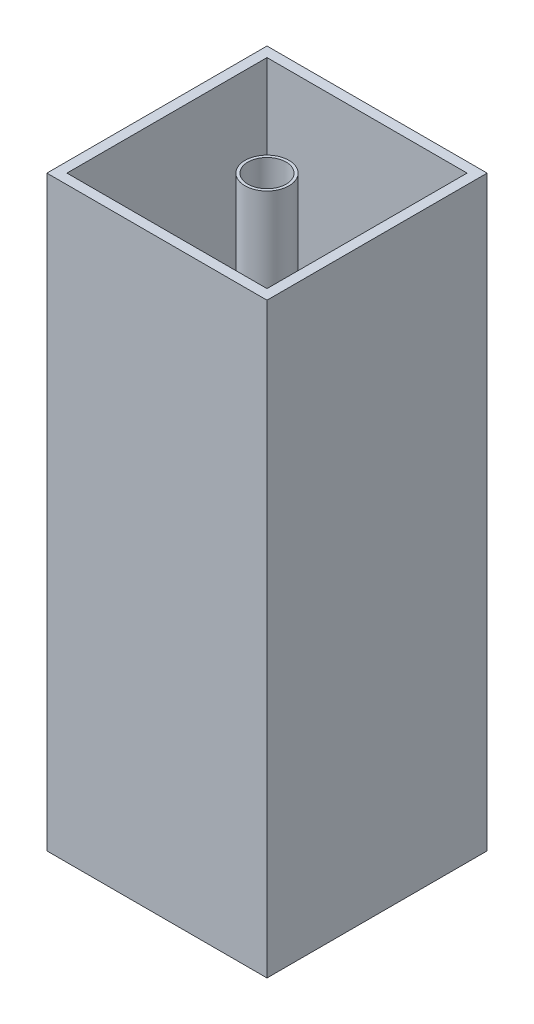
ISO-10303-21;
HEADER;
FILE_DESCRIPTION(('STEP AP214'),'2;1');
FILE_NAME('part.step','',(''),(''),'','','');
FILE_SCHEMA(('AUTOMOTIVE_DESIGN { 1 0 10303 214 1 1 1 1 }'));
ENDSEC;
DATA;
#1=APPLICATION_CONTEXT('core data for automotive mechanical design processes');
#2=APPLICATION_PROTOCOL_DEFINITION('international standard','automotive_design',2000,#1);
#3=PRODUCT_CONTEXT('',#1,'mechanical');
#4=PRODUCT('Part','Part','',(#3));
#5=PRODUCT_RELATED_PRODUCT_CATEGORY('part','',(#4));
#6=PRODUCT_DEFINITION_FORMATION('','',#4);
#7=PRODUCT_DEFINITION_CONTEXT('part definition',#1,'design');
#8=PRODUCT_DEFINITION('design','',#6,#7);
#9=PRODUCT_DEFINITION_SHAPE('','',#8);
#10=(LENGTH_UNIT() NAMED_UNIT(*) SI_UNIT(.MILLI.,.METRE.));
#11=(NAMED_UNIT(*) PLANE_ANGLE_UNIT() SI_UNIT($,.RADIAN.));
#12=(NAMED_UNIT(*) SI_UNIT($,.STERADIAN.) SOLID_ANGLE_UNIT());
#13=UNCERTAINTY_MEASURE_WITH_UNIT(LENGTH_MEASURE(1.E-05),#10,'distance_accuracy_value','');
#14=(GEOMETRIC_REPRESENTATION_CONTEXT(3) GLOBAL_UNCERTAINTY_ASSIGNED_CONTEXT((#13)) GLOBAL_UNIT_ASSIGNED_CONTEXT((#10,
#11,#12)) REPRESENTATION_CONTEXT('',''));
#15=CARTESIAN_POINT('',(0.,0.,0.));
#16=DIRECTION('',(0.,0.,1.));
#17=DIRECTION('',(1.,0.,0.));
#18=AXIS2_PLACEMENT_3D('',#15,#16,#17);
#19=CARTESIAN_POINT('',(0.,9.9999999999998,0.));
#20=DIRECTION('',(0.,1.,0.));
#21=DIRECTION('',(0.,0.,1.));
#22=AXIS2_PLACEMENT_3D('',#19,#20,#21);
#23=PLANE('',#22);
#24=CARTESIAN_POINT('',(0.,9.99999999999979,0.));
#25=DIRECTION('',(0.,1.,0.));
#26=DIRECTION('',(0.,0.,1.));
#27=AXIS2_PLACEMENT_3D('',#24,#25,#26);
#28=CIRCLE('',#27,15.);
#29=CARTESIAN_POINT('',(0.,9.99999999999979,15.));
#30=VERTEX_POINT('',#29);
#31=EDGE_CURVE('E177',#30,#30,#28,.T.);
#32=ORIENTED_EDGE('',*,*,#31,.F.);
#33=EDGE_LOOP('',(#32));
#34=FACE_BOUND('',#33,.T.);
#35=DIRECTION('',(1.,0.,0.));
#36=VECTOR('',#35,1.);
#37=CARTESIAN_POINT('',(0.,9.9999999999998,68.1708922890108));
#38=LINE('',#37,#36);
#39=CARTESIAN_POINT('',(-68.1708922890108,9.9999999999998,68.1708922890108));
#40=VERTEX_POINT('',#39);
#41=CARTESIAN_POINT('',(68.1708922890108,9.9999999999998,68.1708922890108));
#42=VERTEX_POINT('',#41);
#43=EDGE_CURVE('E148',#40,#42,#38,.T.);
#44=ORIENTED_EDGE('',*,*,#43,.T.);
#45=DIRECTION('',(0.,0.,-1.));
#46=VECTOR('',#45,1.);
#47=CARTESIAN_POINT('',(68.1708922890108,9.9999999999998,0.));
#48=LINE('',#47,#46);
#49=CARTESIAN_POINT('',(68.1708922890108,9.9999999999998,-68.1708922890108));
#50=VERTEX_POINT('',#49);
#51=EDGE_CURVE('E114',#42,#50,#48,.T.);
#52=ORIENTED_EDGE('',*,*,#51,.T.);
#53=DIRECTION('',(1.,0.,0.));
#54=VECTOR('',#53,1.);
#55=CARTESIAN_POINT('',(0.,9.9999999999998,-68.1708922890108));
#56=LINE('',#55,#54);
#57=CARTESIAN_POINT('',(-68.1708922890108,9.9999999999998,-68.1708922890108));
#58=VERTEX_POINT('',#57);
#59=EDGE_CURVE('E155',#58,#50,#56,.T.);
#60=ORIENTED_EDGE('',*,*,#59,.F.);
#61=DIRECTION('',(0.,0.,-1.));
#62=VECTOR('',#61,1.);
#63=CARTESIAN_POINT('',(-68.1708922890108,9.9999999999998,0.));
#64=LINE('',#63,#62);
#65=EDGE_CURVE('E153',#40,#58,#64,.T.);
#66=ORIENTED_EDGE('',*,*,#65,.F.);
#67=EDGE_LOOP('',(#44,#52,#60,#66));
#68=FACE_BOUND('',#67,.T.);
#69=ADVANCED_FACE('F42',(#34,#68),#23,.T.);
#70=CARTESIAN_POINT('',(0.,400.,0.));
#71=DIRECTION('',(0.,-1.,0.));
#72=DIRECTION('',(0.,0.,-1.));
#73=AXIS2_PLACEMENT_3D('',#70,#71,#72);
#74=CYLINDRICAL_SURFACE('',#73,15.);
#75=ORIENTED_EDGE('',*,*,#31,.T.);
#76=EDGE_LOOP('',(#75));
#77=FACE_BOUND('',#76,.T.);
#78=CARTESIAN_POINT('',(0.,400.,0.));
#79=DIRECTION('',(0.,1.,0.));
#80=DIRECTION('',(0.,0.,1.));
#81=AXIS2_PLACEMENT_3D('',#78,#79,#80);
#82=CIRCLE('',#81,15.);
#83=CARTESIAN_POINT('',(0.,400.,15.));
#84=VERTEX_POINT('',#83);
#85=EDGE_CURVE('E11',#84,#84,#82,.T.);
#86=ORIENTED_EDGE('',*,*,#85,.F.);
#87=EDGE_LOOP('',(#86));
#88=FACE_BOUND('',#87,.T.);
#89=ADVANCED_FACE('F44',(#77,#88),#74,.T.);
#90=CARTESIAN_POINT('',(0.,400.,0.));
#91=DIRECTION('',(0.,1.,0.));
#92=DIRECTION('',(0.,0.,1.));
#93=AXIS2_PLACEMENT_3D('',#90,#91,#92);
#94=PLANE('',#93);
#95=CARTESIAN_POINT('',(0.,400.,0.));
#96=DIRECTION('',(0.,1.,0.));
#97=DIRECTION('',(0.,0.,1.));
#98=AXIS2_PLACEMENT_3D('',#95,#96,#97);
#99=CIRCLE('',#98,13.0542104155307);
#100=CARTESIAN_POINT('',(0.,400.,13.0542104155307));
#101=VERTEX_POINT('',#100);
#102=EDGE_CURVE('E51',#101,#101,#99,.T.);
#103=ORIENTED_EDGE('',*,*,#102,.F.);
#104=EDGE_LOOP('',(#103));
#105=FACE_BOUND('',#104,.T.);
#106=ORIENTED_EDGE('',*,*,#85,.T.);
#107=EDGE_LOOP('',(#106));
#108=FACE_BOUND('',#107,.T.);
#109=ADVANCED_FACE('F185',(#105,#108),#94,.T.);
#110=CARTESIAN_POINT('',(0.,0.,0.));
#111=DIRECTION('',(0.,1.,0.));
#112=DIRECTION('',(0.,0.,1.));
#113=AXIS2_PLACEMENT_3D('',#110,#111,#112);
#114=CYLINDRICAL_SURFACE('',#113,13.0542104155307);
#115=CARTESIAN_POINT('',(0.,9.9999999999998,0.));
#116=DIRECTION('',(0.,1.,0.));
#117=DIRECTION('',(0.,0.,1.));
#118=AXIS2_PLACEMENT_3D('',#115,#116,#117);
#119=CIRCLE('',#118,13.0542104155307);
#120=CARTESIAN_POINT('',(0.,9.9999999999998,13.0542104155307));
#121=VERTEX_POINT('',#120);
#122=EDGE_CURVE('E46',#121,#121,#119,.F.);
#123=ORIENTED_EDGE('',*,*,#122,.T.);
#124=EDGE_LOOP('',(#123));
#125=FACE_BOUND('',#124,.T.);
#126=ORIENTED_EDGE('',*,*,#102,.T.);
#127=EDGE_LOOP('',(#126));
#128=FACE_BOUND('',#127,.T.);
#129=ADVANCED_FACE('F183',(#125,#128),#114,.F.);
#130=ORIENTED_EDGE('',*,*,#122,.F.);
#131=EDGE_LOOP('',(#130));
#132=FACE_BOUND('',#131,.T.);
#133=ADVANCED_FACE('F198',(#132),#23,.T.);
#134=CARTESIAN_POINT('',(68.1708922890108,0.,0.));
#135=DIRECTION('',(1.,0.,0.));
#136=DIRECTION('',(0.,0.,-1.));
#137=AXIS2_PLACEMENT_3D('',#134,#135,#136);
#138=PLANE('',#137);
#139=ORIENTED_EDGE('',*,*,#51,.F.);
#140=DIRECTION('',(0.,1.,0.));
#141=VECTOR('',#140,1.);
#142=CARTESIAN_POINT('',(68.1708922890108,0.,68.1708922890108));
#143=LINE('',#142,#141);
#144=CARTESIAN_POINT('',(68.1708922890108,400.,68.1708922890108));
#145=VERTEX_POINT('',#144);
#146=EDGE_CURVE('E58',#42,#145,#143,.T.);
#147=ORIENTED_EDGE('',*,*,#146,.T.);
#148=DIRECTION('',(0.,0.,-1.));
#149=VECTOR('',#148,1.);
#150=CARTESIAN_POINT('',(68.1708922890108,400.,0.));
#151=LINE('',#150,#149);
#152=CARTESIAN_POINT('',(68.1708922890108,400.,-68.1708922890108));
#153=VERTEX_POINT('',#152);
#154=EDGE_CURVE('E111',#145,#153,#151,.T.);
#155=ORIENTED_EDGE('',*,*,#154,.T.);
#156=DIRECTION('',(0.,1.,0.));
#157=VECTOR('',#156,1.);
#158=CARTESIAN_POINT('',(68.1708922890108,0.,-68.1708922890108));
#159=LINE('',#158,#157);
#160=EDGE_CURVE('E146',#50,#153,#159,.T.);
#161=ORIENTED_EDGE('',*,*,#160,.F.);
#162=EDGE_LOOP('',(#139,#147,#155,#161));
#163=FACE_BOUND('',#162,.T.);
#164=ADVANCED_FACE('F108',(#163),#138,.F.);
#165=CARTESIAN_POINT('',(0.,0.,-68.1708922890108));
#166=DIRECTION('',(0.,0.,1.));
#167=DIRECTION('',(1.,0.,0.));
#168=AXIS2_PLACEMENT_3D('',#165,#166,#167);
#169=PLANE('',#168);
#170=DIRECTION('',(0.,1.,0.));
#171=VECTOR('',#170,1.);
#172=CARTESIAN_POINT('',(-68.1708922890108,0.,-68.1708922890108));
#173=LINE('',#172,#171);
#174=CARTESIAN_POINT('',(-68.1708922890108,400.,-68.1708922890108));
#175=VERTEX_POINT('',#174);
#176=EDGE_CURVE('E149',#58,#175,#173,.T.);
#177=ORIENTED_EDGE('',*,*,#176,.F.);
#178=ORIENTED_EDGE('',*,*,#59,.T.);
#179=ORIENTED_EDGE('',*,*,#160,.T.);
#180=DIRECTION('',(1.,0.,0.));
#181=VECTOR('',#180,1.);
#182=CARTESIAN_POINT('',(0.,400.,-68.1708922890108));
#183=LINE('',#182,#181);
#184=EDGE_CURVE('E131',#175,#153,#183,.T.);
#185=ORIENTED_EDGE('',*,*,#184,.F.);
#186=EDGE_LOOP('',(#177,#178,#179,#185));
#187=FACE_BOUND('',#186,.T.);
#188=ADVANCED_FACE('F207',(#187),#169,.T.);
#189=CARTESIAN_POINT('',(-68.1708922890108,0.,0.));
#190=DIRECTION('',(1.,0.,0.));
#191=DIRECTION('',(0.,0.,-1.));
#192=AXIS2_PLACEMENT_3D('',#189,#190,#191);
#193=PLANE('',#192);
#194=DIRECTION('',(0.,1.,0.));
#195=VECTOR('',#194,1.);
#196=CARTESIAN_POINT('',(-68.1708922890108,0.,68.1708922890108));
#197=LINE('',#196,#195);
#198=CARTESIAN_POINT('',(-68.1708922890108,400.,68.1708922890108));
#199=VERTEX_POINT('',#198);
#200=EDGE_CURVE('E116',#40,#199,#197,.T.);
#201=ORIENTED_EDGE('',*,*,#200,.F.);
#202=ORIENTED_EDGE('',*,*,#65,.T.);
#203=ORIENTED_EDGE('',*,*,#176,.T.);
#204=DIRECTION('',(0.,0.,-1.));
#205=VECTOR('',#204,1.);
#206=CARTESIAN_POINT('',(-68.1708922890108,400.,0.));
#207=LINE('',#206,#205);
#208=EDGE_CURVE('E126',#199,#175,#207,.T.);
#209=ORIENTED_EDGE('',*,*,#208,.F.);
#210=EDGE_LOOP('',(#201,#202,#203,#209));
#211=FACE_BOUND('',#210,.T.);
#212=ADVANCED_FACE('F204',(#211),#193,.T.);
#213=CARTESIAN_POINT('',(0.,0.,68.1708922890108));
#214=DIRECTION('',(0.,0.,1.));
#215=DIRECTION('',(1.,0.,0.));
#216=AXIS2_PLACEMENT_3D('',#213,#214,#215);
#217=PLANE('',#216);
#218=ORIENTED_EDGE('',*,*,#43,.F.);
#219=ORIENTED_EDGE('',*,*,#200,.T.);
#220=DIRECTION('',(1.,0.,0.));
#221=VECTOR('',#220,1.);
#222=CARTESIAN_POINT('',(0.,400.,68.1708922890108));
#223=LINE('',#222,#221);
#224=EDGE_CURVE('E120',#199,#145,#223,.T.);
#225=ORIENTED_EDGE('',*,*,#224,.T.);
#226=ORIENTED_EDGE('',*,*,#146,.F.);
#227=EDGE_LOOP('',(#218,#219,#225,#226));
#228=FACE_BOUND('',#227,.T.);
#229=ADVANCED_FACE('F121',(#228),#217,.F.);
#230=CARTESIAN_POINT('',(0.,400.,0.));
#231=DIRECTION('',(0.,1.,0.));
#232=DIRECTION('',(0.,0.,1.));
#233=AXIS2_PLACEMENT_3D('',#230,#231,#232);
#234=PLANE('',#233);
#235=ORIENTED_EDGE('',*,*,#154,.F.);
#236=ORIENTED_EDGE('',*,*,#224,.F.);
#237=ORIENTED_EDGE('',*,*,#208,.T.);
#238=ORIENTED_EDGE('',*,*,#184,.T.);
#239=EDGE_LOOP('',(#235,#236,#237,#238));
#240=FACE_BOUND('',#239,.T.);
#241=DIRECTION('',(1.,0.,0.));
#242=VECTOR('',#241,1.);
#243=CARTESIAN_POINT('',(0.,400.,75.));
#244=LINE('',#243,#242);
#245=CARTESIAN_POINT('',(-75.,400.,75.));
#246=VERTEX_POINT('',#245);
#247=CARTESIAN_POINT('',(75.,400.,75.));
#248=VERTEX_POINT('',#247);
#249=EDGE_CURVE('E136',#246,#248,#244,.T.);
#250=ORIENTED_EDGE('',*,*,#249,.T.);
#251=DIRECTION('',(0.,0.,-1.));
#252=VECTOR('',#251,1.);
#253=CARTESIAN_POINT('',(75.,400.,0.));
#254=LINE('',#253,#252);
#255=CARTESIAN_POINT('',(75.,400.,-75.));
#256=VERTEX_POINT('',#255);
#257=EDGE_CURVE('E139',#248,#256,#254,.T.);
#258=ORIENTED_EDGE('',*,*,#257,.T.);
#259=DIRECTION('',(1.,0.,0.));
#260=VECTOR('',#259,1.);
#261=CARTESIAN_POINT('',(0.,400.,-75.));
#262=LINE('',#261,#260);
#263=CARTESIAN_POINT('',(-75.,400.,-75.));
#264=VERTEX_POINT('',#263);
#265=EDGE_CURVE('E142',#264,#256,#262,.T.);
#266=ORIENTED_EDGE('',*,*,#265,.F.);
#267=DIRECTION('',(0.,0.,-1.));
#268=VECTOR('',#267,1.);
#269=CARTESIAN_POINT('',(-75.,400.,0.));
#270=LINE('',#269,#268);
#271=EDGE_CURVE('E117',#246,#264,#270,.T.);
#272=ORIENTED_EDGE('',*,*,#271,.F.);
#273=EDGE_LOOP('',(#250,#258,#266,#272));
#274=FACE_BOUND('',#273,.T.);
#275=ADVANCED_FACE('F128',(#240,#274),#234,.T.);
#276=CARTESIAN_POINT('',(0.,0.,0.));
#277=DIRECTION('',(0.,1.,0.));
#278=DIRECTION('',(0.,0.,1.));
#279=AXIS2_PLACEMENT_3D('',#276,#277,#278);
#280=PLANE('',#279);
#281=DIRECTION('',(0.,0.,1.));
#282=VECTOR('',#281,1.);
#283=CARTESIAN_POINT('',(75.,0.,-75.));
#284=LINE('',#283,#282);
#285=CARTESIAN_POINT('',(75.,0.,-75.));
#286=VERTEX_POINT('',#285);
#287=CARTESIAN_POINT('',(75.,0.,75.));
#288=VERTEX_POINT('',#287);
#289=EDGE_CURVE('E158',#286,#288,#284,.T.);
#290=ORIENTED_EDGE('',*,*,#289,.T.);
#291=DIRECTION('',(-1.,0.,0.));
#292=VECTOR('',#291,1.);
#293=CARTESIAN_POINT('',(-75.,0.,75.));
#294=LINE('',#293,#292);
#295=CARTESIAN_POINT('',(-75.,0.,75.));
#296=VERTEX_POINT('',#295);
#297=EDGE_CURVE('E161',#288,#296,#294,.T.);
#298=ORIENTED_EDGE('',*,*,#297,.T.);
#299=DIRECTION('',(0.,0.,-1.));
#300=VECTOR('',#299,1.);
#301=CARTESIAN_POINT('',(-75.,0.,-75.));
#302=LINE('',#301,#300);
#303=CARTESIAN_POINT('',(-75.,0.,-75.));
#304=VERTEX_POINT('',#303);
#305=EDGE_CURVE('E164',#296,#304,#302,.T.);
#306=ORIENTED_EDGE('',*,*,#305,.T.);
#307=DIRECTION('',(1.,0.,0.));
#308=VECTOR('',#307,1.);
#309=CARTESIAN_POINT('',(-75.,0.,-75.));
#310=LINE('',#309,#308);
#311=EDGE_CURVE('E167',#304,#286,#310,.T.);
#312=ORIENTED_EDGE('',*,*,#311,.T.);
#313=EDGE_LOOP('',(#290,#298,#306,#312));
#314=FACE_BOUND('',#313,.T.);
#315=ADVANCED_FACE('F234',(#314),#280,.F.);
#316=CARTESIAN_POINT('',(75.,9.9999999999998,-75.));
#317=DIRECTION('',(1.,0.,0.));
#318=DIRECTION('',(0.,0.,-1.));
#319=AXIS2_PLACEMENT_3D('',#316,#317,#318);
#320=PLANE('',#319);
#321=ORIENTED_EDGE('',*,*,#289,.F.);
#322=DIRECTION('',(0.,-1.,0.));
#323=VECTOR('',#322,1.);
#324=CARTESIAN_POINT('',(75.,9.9999999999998,-75.));
#325=LINE('',#324,#323);
#326=EDGE_CURVE('E66',#256,#286,#325,.T.);
#327=ORIENTED_EDGE('',*,*,#326,.F.);
#328=ORIENTED_EDGE('',*,*,#257,.F.);
#329=DIRECTION('',(0.,-1.,0.));
#330=VECTOR('',#329,1.);
#331=CARTESIAN_POINT('',(75.,9.9999999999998,75.));
#332=LINE('',#331,#330);
#333=EDGE_CURVE('E170',#248,#288,#332,.T.);
#334=ORIENTED_EDGE('',*,*,#333,.T.);
#335=EDGE_LOOP('',(#321,#327,#328,#334));
#336=FACE_BOUND('',#335,.T.);
#337=ADVANCED_FACE('F224',(#336),#320,.T.);
#338=CARTESIAN_POINT('',(-75.,9.9999999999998,-75.));
#339=DIRECTION('',(0.,0.,-1.));
#340=DIRECTION('',(-1.,0.,0.));
#341=AXIS2_PLACEMENT_3D('',#338,#339,#340);
#342=PLANE('',#341);
#343=ORIENTED_EDGE('',*,*,#311,.F.);
#344=DIRECTION('',(0.,-1.,0.));
#345=VECTOR('',#344,1.);
#346=CARTESIAN_POINT('',(-75.,9.9999999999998,-75.));
#347=LINE('',#346,#345);
#348=EDGE_CURVE('E172',#264,#304,#347,.T.);
#349=ORIENTED_EDGE('',*,*,#348,.F.);
#350=ORIENTED_EDGE('',*,*,#265,.T.);
#351=ORIENTED_EDGE('',*,*,#326,.T.);
#352=EDGE_LOOP('',(#343,#349,#350,#351));
#353=FACE_BOUND('',#352,.T.);
#354=ADVANCED_FACE('F220',(#353),#342,.T.);
#355=CARTESIAN_POINT('',(-75.,9.9999999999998,-75.));
#356=DIRECTION('',(-1.,0.,0.));
#357=DIRECTION('',(0.,0.,1.));
#358=AXIS2_PLACEMENT_3D('',#355,#356,#357);
#359=PLANE('',#358);
#360=ORIENTED_EDGE('',*,*,#305,.F.);
#361=DIRECTION('',(0.,-1.,0.));
#362=VECTOR('',#361,1.);
#363=CARTESIAN_POINT('',(-75.,9.9999999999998,75.));
#364=LINE('',#363,#362);
#365=EDGE_CURVE('E174',#246,#296,#364,.T.);
#366=ORIENTED_EDGE('',*,*,#365,.F.);
#367=ORIENTED_EDGE('',*,*,#271,.T.);
#368=ORIENTED_EDGE('',*,*,#348,.T.);
#369=EDGE_LOOP('',(#360,#366,#367,#368));
#370=FACE_BOUND('',#369,.T.);
#371=ADVANCED_FACE('F223',(#370),#359,.T.);
#372=CARTESIAN_POINT('',(-75.,9.9999999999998,75.));
#373=DIRECTION('',(0.,0.,1.));
#374=DIRECTION('',(1.,0.,0.));
#375=AXIS2_PLACEMENT_3D('',#372,#373,#374);
#376=PLANE('',#375);
#377=ORIENTED_EDGE('',*,*,#297,.F.);
#378=ORIENTED_EDGE('',*,*,#333,.F.);
#379=ORIENTED_EDGE('',*,*,#249,.F.);
#380=ORIENTED_EDGE('',*,*,#365,.T.);
#381=EDGE_LOOP('',(#377,#378,#379,#380));
#382=FACE_BOUND('',#381,.T.);
#383=ADVANCED_FACE('F227',(#382),#376,.T.);
#384=CLOSED_SHELL('',(#69,#89,#109,#129,#133,#164,#188,#212,#229,#275,#315,#337,#354,#371,#383));
#385=MANIFOLD_SOLID_BREP('B2',#384);
#386=ADVANCED_BREP_SHAPE_REPRESENTATION('',(#18,#385),#14);
#387=SHAPE_DEFINITION_REPRESENTATION(#9,#386);
ENDSEC;
END-ISO-10303-21;
